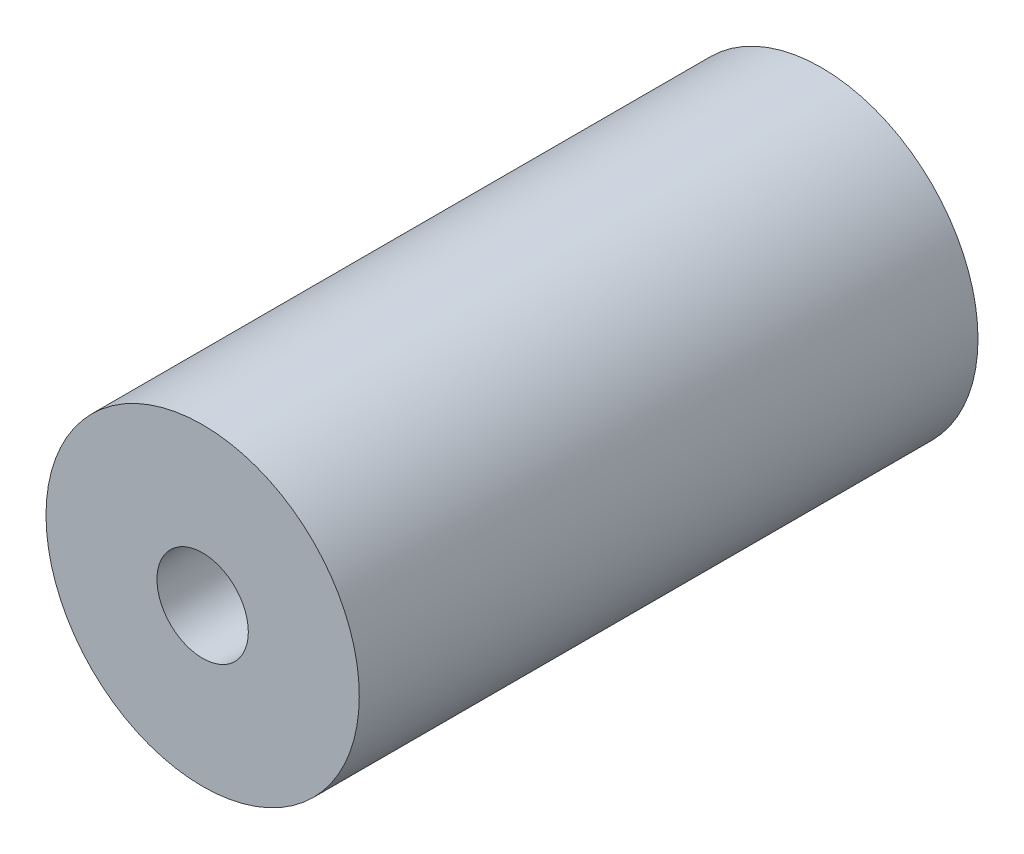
ISO-10303-21;
HEADER;
FILE_DESCRIPTION(('STEP AP214'),'2;1');
FILE_NAME('part.step','',(''),(''),'','','');
FILE_SCHEMA(('AUTOMOTIVE_DESIGN { 1 0 10303 214 1 1 1 1 }'));
ENDSEC;
DATA;
#1=APPLICATION_CONTEXT('core data for automotive mechanical design processes');
#2=APPLICATION_PROTOCOL_DEFINITION('international standard','automotive_design',2000,#1);
#3=PRODUCT_CONTEXT('',#1,'mechanical');
#4=PRODUCT('Part','Part','',(#3));
#5=PRODUCT_RELATED_PRODUCT_CATEGORY('part','',(#4));
#6=PRODUCT_DEFINITION_FORMATION('','',#4);
#7=PRODUCT_DEFINITION_CONTEXT('part definition',#1,'design');
#8=PRODUCT_DEFINITION('design','',#6,#7);
#9=PRODUCT_DEFINITION_SHAPE('','',#8);
#10=(LENGTH_UNIT() NAMED_UNIT(*) SI_UNIT(.MILLI.,.METRE.));
#11=(NAMED_UNIT(*) PLANE_ANGLE_UNIT() SI_UNIT($,.RADIAN.));
#12=(NAMED_UNIT(*) SI_UNIT($,.STERADIAN.) SOLID_ANGLE_UNIT());
#13=UNCERTAINTY_MEASURE_WITH_UNIT(LENGTH_MEASURE(1.E-05),#10,'distance_accuracy_value','');
#14=(GEOMETRIC_REPRESENTATION_CONTEXT(3) GLOBAL_UNCERTAINTY_ASSIGNED_CONTEXT((#13)) GLOBAL_UNIT_ASSIGNED_CONTEXT((#10,
#11,#12)) REPRESENTATION_CONTEXT('',''));
#15=CARTESIAN_POINT('',(0.,0.,0.));
#16=DIRECTION('',(0.,0.,1.));
#17=DIRECTION('',(1.,0.,0.));
#18=AXIS2_PLACEMENT_3D('',#15,#16,#17);
#19=CARTESIAN_POINT('',(0.,0.,23.7));
#20=DIRECTION('',(0.,0.,1.));
#21=DIRECTION('',(1.,0.,0.));
#22=AXIS2_PLACEMENT_3D('',#19,#20,#21);
#23=PLANE('',#22);
#24=CARTESIAN_POINT('',(0.,0.,23.7));
#25=DIRECTION('',(0.,0.,1.));
#26=DIRECTION('',(1.,0.,0.));
#27=AXIS2_PLACEMENT_3D('',#24,#25,#26);
#28=CIRCLE('',#27,6.);
#29=CARTESIAN_POINT('',(6.,0.,23.7));
#30=VERTEX_POINT('',#29);
#31=EDGE_CURVE('E10',#30,#30,#28,.T.);
#32=ORIENTED_EDGE('',*,*,#31,.T.);
#33=EDGE_LOOP('',(#32));
#34=FACE_BOUND('',#33,.T.);
#35=CARTESIAN_POINT('',(0.,0.,23.7));
#36=DIRECTION('',(0.,0.,1.));
#37=DIRECTION('',(1.,0.,0.));
#38=AXIS2_PLACEMENT_3D('',#35,#36,#37);
#39=CIRCLE('',#38,1.75);
#40=CARTESIAN_POINT('',(1.75,0.,23.7));
#41=VERTEX_POINT('',#40);
#42=EDGE_CURVE('E41',#41,#41,#39,.T.);
#43=ORIENTED_EDGE('',*,*,#42,.F.);
#44=EDGE_LOOP('',(#43));
#45=FACE_BOUND('',#44,.T.);
#46=ADVANCED_FACE('F30',(#34,#45),#23,.T.);
#47=CARTESIAN_POINT('',(0.,0.,0.));
#48=DIRECTION('',(0.,0.,1.));
#49=DIRECTION('',(1.,0.,0.));
#50=AXIS2_PLACEMENT_3D('',#47,#48,#49);
#51=PLANE('',#50);
#52=CARTESIAN_POINT('',(0.,0.,0.));
#53=DIRECTION('',(0.,0.,1.));
#54=DIRECTION('',(1.,0.,0.));
#55=AXIS2_PLACEMENT_3D('',#52,#53,#54);
#56=CIRCLE('',#55,6.);
#57=CARTESIAN_POINT('',(6.,0.,0.));
#58=VERTEX_POINT('',#57);
#59=EDGE_CURVE('E34',#58,#58,#56,.T.);
#60=ORIENTED_EDGE('',*,*,#59,.F.);
#61=EDGE_LOOP('',(#60));
#62=FACE_BOUND('',#61,.T.);
#63=CARTESIAN_POINT('',(0.,0.,0.));
#64=DIRECTION('',(0.,0.,1.));
#65=DIRECTION('',(1.,0.,0.));
#66=AXIS2_PLACEMENT_3D('',#63,#64,#65);
#67=CIRCLE('',#66,1.75);
#68=CARTESIAN_POINT('',(1.75,0.,0.));
#69=VERTEX_POINT('',#68);
#70=EDGE_CURVE('E43',#69,#69,#67,.T.);
#71=ORIENTED_EDGE('',*,*,#70,.T.);
#72=EDGE_LOOP('',(#71));
#73=FACE_BOUND('',#72,.T.);
#74=ADVANCED_FACE('F53',(#62,#73),#51,.F.);
#75=CARTESIAN_POINT('',(0.,0.,23.7));
#76=DIRECTION('',(0.,0.,-1.));
#77=DIRECTION('',(-1.,0.,0.));
#78=AXIS2_PLACEMENT_3D('',#75,#76,#77);
#79=CYLINDRICAL_SURFACE('',#78,6.);
#80=ORIENTED_EDGE('',*,*,#31,.F.);
#81=EDGE_LOOP('',(#80));
#82=FACE_BOUND('',#81,.T.);
#83=ORIENTED_EDGE('',*,*,#59,.T.);
#84=EDGE_LOOP('',(#83));
#85=FACE_BOUND('',#84,.T.);
#86=ADVANCED_FACE('F32',(#82,#85),#79,.T.);
#87=CARTESIAN_POINT('',(0.,0.,23.7));
#88=DIRECTION('',(0.,0.,-1.));
#89=DIRECTION('',(-1.,0.,0.));
#90=AXIS2_PLACEMENT_3D('',#87,#88,#89);
#91=CYLINDRICAL_SURFACE('',#90,1.75);
#92=ORIENTED_EDGE('',*,*,#42,.T.);
#93=EDGE_LOOP('',(#92));
#94=FACE_BOUND('',#93,.T.);
#95=ORIENTED_EDGE('',*,*,#70,.F.);
#96=EDGE_LOOP('',(#95));
#97=FACE_BOUND('',#96,.T.);
#98=ADVANCED_FACE('F49',(#94,#97),#91,.F.);
#99=CLOSED_SHELL('',(#46,#74,#86,#98));
#100=MANIFOLD_SOLID_BREP('B2',#99);
#101=ADVANCED_BREP_SHAPE_REPRESENTATION('',(#18,#100),#14);
#102=SHAPE_DEFINITION_REPRESENTATION(#9,#101);
ENDSEC;
END-ISO-10303-21;
